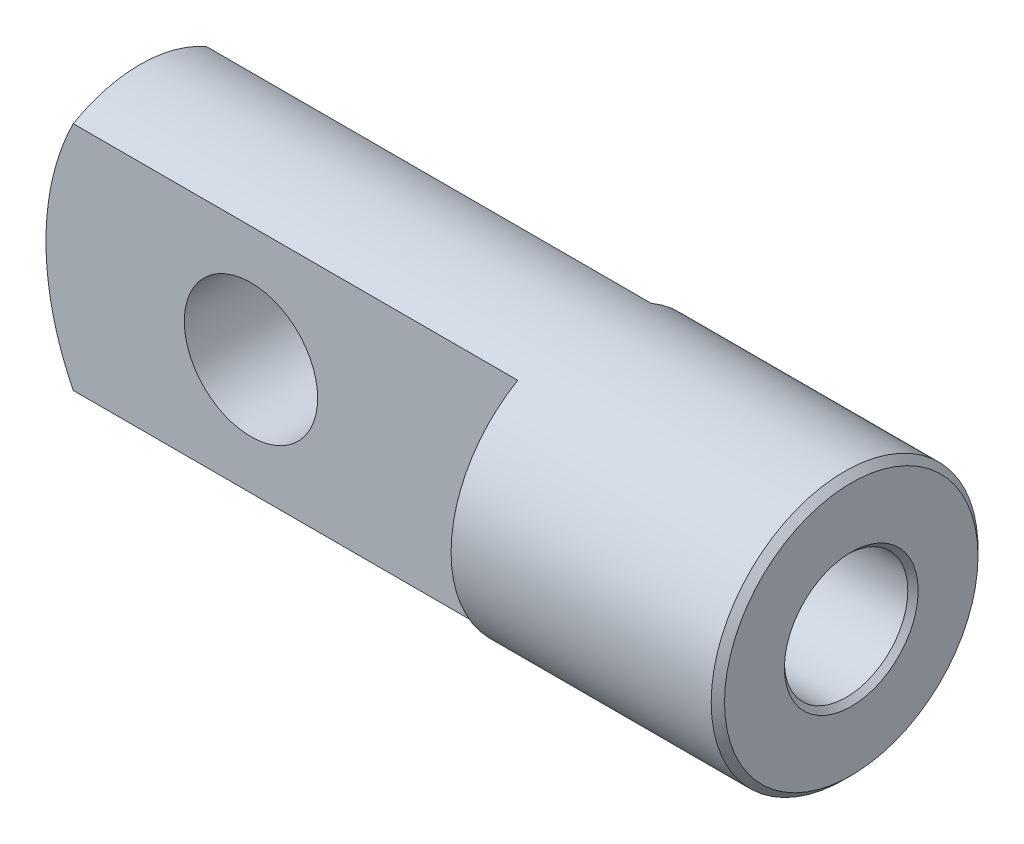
from build123d import *

# Parameters (mm, degrees)
CUT_EXTRUDE_1_DEPTH  = 50
SKETCH_3_R           = 10
CUT_EXTRUDE_2_DEPTH  = 30
M20X1_51_D           = 18.5
M20X1_51_DEPTH       = 35.5
M20X1_51_CSINK_D     = 20.05
M20X1_51_CSINK_ANGLE = 90
M20X1_51_TIP         = 5.557960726


with BuildPart() as part:
    # Sketch 1 → Revolve 1 (revolve)
    with BuildSketch(Plane.XY, mode=Mode.PRIVATE) as revolve_1_sk:
        with BuildLine():
            Line((0, 0), (0, 19))
            Line((0, 19), (-1, 20))
            Line((-1, 20), (-106.641016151, 20))
            ThreePointArc((-106.641016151, 20), (-110.637033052, 10.352761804), (-112, 0))
            Line((-112, 0), (0, 0))
        make_face()
    revolve(revolve_1_sk.sketch.rotate(Axis((-112, 0, 0), (1, 0, 0)), 90), axis=Axis((-112, 0, 0), (1, 0, 0)))

    # Sketch 2 → Cut-Extrude 1 (cut)
    with BuildSketch(Plane(origin=(0, 20, 0), x_dir=(1, 0, 0), z_dir=(0, 1, 0))):
        Polygon((-112, -10), (-112, 10), (-40, 10), (-40, 26.185176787), (-127.072153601, 26.185176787), (-127.072153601, -26.185176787), (-40, -26.185176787), (-40, -10), align=None)
    extrude(amount=-CUT_EXTRUDE_1_DEPTH, mode=Mode.SUBTRACT)

    # Sketch 3 → Cut-Extrude 2 (cut)
    with BuildSketch(Plane.XY.offset(10)):
        with Locations((-80, 0)):
            Circle(SKETCH_3_R)
    extrude(amount=-CUT_EXTRUDE_2_DEPTH, mode=Mode.SUBTRACT)

    # M20x1_51
    with Locations(Plane(origin=(0, 0, 0), x_dir=(0, 0, -1), z_dir=(1, 0, 0))):
        with Locations((0, 0)):
            CounterSinkHole(M20X1_51_D / 2, M20X1_51_CSINK_D / 2, depth=M20X1_51_DEPTH, counter_sink_angle=M20X1_51_CSINK_ANGLE)
            with Locations((0, 0, -(M20X1_51_DEPTH + M20X1_51_TIP / 2))):  # 118° drill point
                Cone(0, M20X1_51_D / 2, M20X1_51_TIP, mode=Mode.SUBTRACT)


solid = part.part
